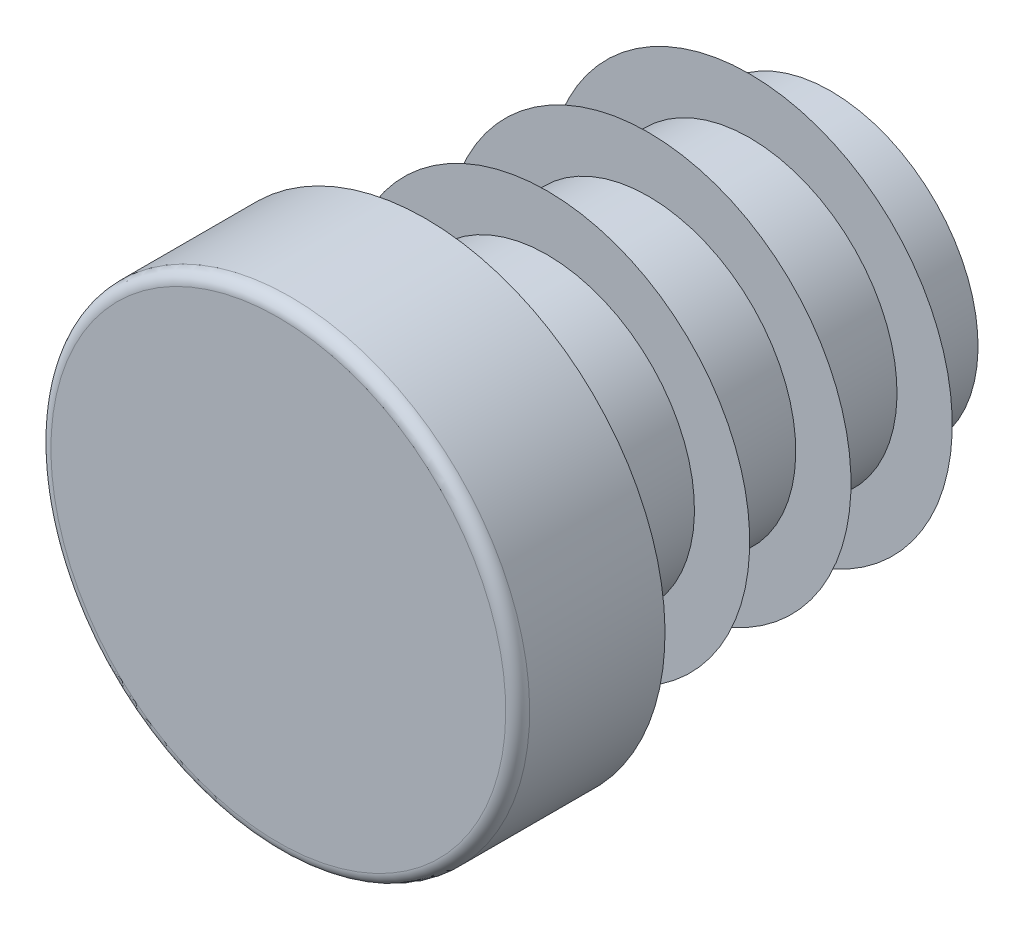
ISO-10303-21;
HEADER;
FILE_DESCRIPTION(('STEP AP214'),'2;1');
FILE_NAME('part.step','',(''),(''),'','','');
FILE_SCHEMA(('AUTOMOTIVE_DESIGN { 1 0 10303 214 1 1 1 1 }'));
ENDSEC;
DATA;
#1=APPLICATION_CONTEXT('core data for automotive mechanical design processes');
#2=APPLICATION_PROTOCOL_DEFINITION('international standard','automotive_design',2000,#1);
#3=PRODUCT_CONTEXT('',#1,'mechanical');
#4=PRODUCT('Part','Part','',(#3));
#5=PRODUCT_RELATED_PRODUCT_CATEGORY('part','',(#4));
#6=PRODUCT_DEFINITION_FORMATION('','',#4);
#7=PRODUCT_DEFINITION_CONTEXT('part definition',#1,'design');
#8=PRODUCT_DEFINITION('design','',#6,#7);
#9=PRODUCT_DEFINITION_SHAPE('','',#8);
#10=(LENGTH_UNIT() NAMED_UNIT(*) SI_UNIT(.MILLI.,.METRE.));
#11=(NAMED_UNIT(*) PLANE_ANGLE_UNIT() SI_UNIT($,.RADIAN.));
#12=(NAMED_UNIT(*) SI_UNIT($,.STERADIAN.) SOLID_ANGLE_UNIT());
#13=UNCERTAINTY_MEASURE_WITH_UNIT(LENGTH_MEASURE(1.E-05),#10,'distance_accuracy_value','');
#14=(GEOMETRIC_REPRESENTATION_CONTEXT(3) GLOBAL_UNCERTAINTY_ASSIGNED_CONTEXT((#13)) GLOBAL_UNIT_ASSIGNED_CONTEXT((#10,
#11,#12)) REPRESENTATION_CONTEXT('',''));
#15=CARTESIAN_POINT('',(0.,0.,0.));
#16=DIRECTION('',(0.,0.,1.));
#17=DIRECTION('',(1.,0.,0.));
#18=AXIS2_PLACEMENT_3D('',#15,#16,#17);
#19=CARTESIAN_POINT('',(0.,0.,4.));
#20=DIRECTION('',(0.,0.,-1.));
#21=DIRECTION('',(0.,1.,0.));
#22=AXIS2_PLACEMENT_3D('',#19,#20,#21);
#23=PLANE('',#22);
#24=CARTESIAN_POINT('',(0.,0.,4.));
#25=DIRECTION('',(0.,0.,-1.));
#26=DIRECTION('',(0.,1.,0.));
#27=AXIS2_PLACEMENT_3D('',#24,#25,#26);
#28=CIRCLE('',#27,6.175);
#29=CARTESIAN_POINT('',(0.,6.175,4.));
#30=VERTEX_POINT('',#29);
#31=EDGE_CURVE('E8',#30,#30,#28,.T.);
#32=ORIENTED_EDGE('',*,*,#31,.F.);
#33=EDGE_LOOP('',(#32));
#34=FACE_BOUND('',#33,.T.);
#35=ADVANCED_FACE('F12',(#34),#23,.F.);
#36=CARTESIAN_POINT('',(0.,0.,3.675));
#37=DIRECTION('',(0.,0.,-1.));
#38=DIRECTION('',(0.,1.,0.));
#39=AXIS2_PLACEMENT_3D('',#36,#37,#38);
#40=TOROIDAL_SURFACE('',#39,6.175,0.325);
#41=ORIENTED_EDGE('',*,*,#31,.T.);
#42=EDGE_LOOP('',(#41));
#43=FACE_BOUND('',#42,.T.);
#44=CARTESIAN_POINT('',(0.,0.,3.675));
#45=DIRECTION('',(0.,0.,-1.));
#46=DIRECTION('',(0.,1.,0.));
#47=AXIS2_PLACEMENT_3D('',#44,#45,#46);
#48=CIRCLE('',#47,6.5);
#49=CARTESIAN_POINT('',(0.,6.5,3.675));
#50=VERTEX_POINT('',#49);
#51=EDGE_CURVE('E18',#50,#50,#48,.T.);
#52=ORIENTED_EDGE('',*,*,#51,.F.);
#53=EDGE_LOOP('',(#52));
#54=FACE_BOUND('',#53,.T.);
#55=ADVANCED_FACE('F159',(#43,#54),#40,.T.);
#56=CARTESIAN_POINT('',(0.,0.,-11.));
#57=DIRECTION('',(0.,0.,-1.));
#58=DIRECTION('',(0.,1.,0.));
#59=AXIS2_PLACEMENT_3D('',#56,#57,#58);
#60=CYLINDRICAL_SURFACE('',#59,6.5);
#61=CARTESIAN_POINT('',(0.,0.,0.));
#62=DIRECTION('',(0.,0.,-1.));
#63=DIRECTION('',(0.,1.,0.));
#64=AXIS2_PLACEMENT_3D('',#61,#62,#63);
#65=CIRCLE('',#64,6.5);
#66=CARTESIAN_POINT('',(0.,6.5,0.));
#67=VERTEX_POINT('',#66);
#68=EDGE_CURVE('E22',#67,#67,#65,.T.);
#69=ORIENTED_EDGE('',*,*,#68,.F.);
#70=EDGE_LOOP('',(#69));
#71=FACE_BOUND('',#70,.T.);
#72=ORIENTED_EDGE('',*,*,#51,.T.);
#73=EDGE_LOOP('',(#72));
#74=FACE_BOUND('',#73,.T.);
#75=ADVANCED_FACE('F154',(#71,#74),#60,.T.);
#76=CARTESIAN_POINT('',(6.5,0.,0.));
#77=DIRECTION('',(0.,0.,1.));
#78=DIRECTION('',(0.,-1.,0.));
#79=AXIS2_PLACEMENT_3D('',#76,#77,#78);
#80=PLANE('',#79);
#81=CARTESIAN_POINT('',(0.,0.,0.));
#82=DIRECTION('',(0.,0.,-1.));
#83=DIRECTION('',(0.,1.,0.));
#84=AXIS2_PLACEMENT_3D('',#81,#82,#83);
#85=CIRCLE('',#84,4.);
#86=CARTESIAN_POINT('',(0.,4.,0.));
#87=VERTEX_POINT('',#86);
#88=EDGE_CURVE('E26',#87,#87,#85,.T.);
#89=ORIENTED_EDGE('',*,*,#88,.F.);
#90=EDGE_LOOP('',(#89));
#91=FACE_BOUND('',#90,.T.);
#92=ORIENTED_EDGE('',*,*,#68,.T.);
#93=EDGE_LOOP('',(#92));
#94=FACE_BOUND('',#93,.T.);
#95=ADVANCED_FACE('F148',(#91,#94),#80,.F.);
#96=CARTESIAN_POINT('',(0.,0.,-11.));
#97=DIRECTION('',(0.,0.,-1.));
#98=DIRECTION('',(0.,1.,0.));
#99=AXIS2_PLACEMENT_3D('',#96,#97,#98);
#100=CYLINDRICAL_SURFACE('',#99,4.);
#101=CARTESIAN_POINT('',(0.,0.,-0.55));
#102=DIRECTION('',(0.,0.,-1.));
#103=DIRECTION('',(0.,1.,0.));
#104=AXIS2_PLACEMENT_3D('',#101,#102,#103);
#105=CIRCLE('',#104,4.);
#106=CARTESIAN_POINT('',(0.,4.,-0.55));
#107=VERTEX_POINT('',#106);
#108=EDGE_CURVE('E31',#107,#107,#105,.T.);
#109=ORIENTED_EDGE('',*,*,#108,.F.);
#110=EDGE_LOOP('',(#109));
#111=FACE_BOUND('',#110,.T.);
#112=ORIENTED_EDGE('',*,*,#88,.T.);
#113=EDGE_LOOP('',(#112));
#114=FACE_BOUND('',#113,.T.);
#115=ADVANCED_FACE('F142',(#111,#114),#100,.T.);
#116=CARTESIAN_POINT('',(4.,0.,-0.55));
#117=DIRECTION('',(0.,0.,-1.));
#118=DIRECTION('',(0.,1.,0.));
#119=AXIS2_PLACEMENT_3D('',#116,#117,#118);
#120=PLANE('',#119);
#121=CARTESIAN_POINT('',(0.,0.,-0.55));
#122=DIRECTION('',(0.,0.,-1.));
#123=DIRECTION('',(0.,1.,0.));
#124=AXIS2_PLACEMENT_3D('',#121,#122,#123);
#125=CIRCLE('',#124,5.5);
#126=CARTESIAN_POINT('',(0.,5.5,-0.55));
#127=VERTEX_POINT('',#126);
#128=EDGE_CURVE('E34',#127,#127,#125,.T.);
#129=ORIENTED_EDGE('',*,*,#128,.F.);
#130=EDGE_LOOP('',(#129));
#131=FACE_BOUND('',#130,.T.);
#132=ORIENTED_EDGE('',*,*,#108,.T.);
#133=EDGE_LOOP('',(#132));
#134=FACE_BOUND('',#133,.T.);
#135=ADVANCED_FACE('F136',(#131,#134),#120,.F.);
#136=CARTESIAN_POINT('',(0.,0.,-0.55));
#137=DIRECTION('',(0.,0.,1.));
#138=DIRECTION('',(0.,-1.,0.));
#139=AXIS2_PLACEMENT_3D('',#136,#137,#138);
#140=CONICAL_SURFACE('',#139,5.5,0.959931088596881);
#141=CARTESIAN_POINT('',(0.,0.,-1.60031130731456));
#142=DIRECTION('',(0.,0.,-1.));
#143=DIRECTION('',(0.,1.,0.));
#144=AXIS2_PLACEMENT_3D('',#141,#142,#143);
#145=CIRCLE('',#144,4.);
#146=CARTESIAN_POINT('',(0.,4.,-1.60031130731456));
#147=VERTEX_POINT('',#146);
#148=EDGE_CURVE('E37',#147,#147,#145,.T.);
#149=ORIENTED_EDGE('',*,*,#148,.F.);
#150=EDGE_LOOP('',(#149));
#151=FACE_BOUND('',#150,.T.);
#152=ORIENTED_EDGE('',*,*,#128,.T.);
#153=EDGE_LOOP('',(#152));
#154=FACE_BOUND('',#153,.T.);
#155=ADVANCED_FACE('F130',(#151,#154),#140,.T.);
#156=CARTESIAN_POINT('',(0.,0.,-11.));
#157=DIRECTION('',(0.,0.,-1.));
#158=DIRECTION('',(0.,1.,0.));
#159=AXIS2_PLACEMENT_3D('',#156,#157,#158);
#160=CYLINDRICAL_SURFACE('',#159,4.);
#161=CARTESIAN_POINT('',(0.,0.,-3.3));
#162=DIRECTION('',(0.,0.,-1.));
#163=DIRECTION('',(0.,1.,0.));
#164=AXIS2_PLACEMENT_3D('',#161,#162,#163);
#165=CIRCLE('',#164,4.);
#166=CARTESIAN_POINT('',(0.,4.,-3.3));
#167=VERTEX_POINT('',#166);
#168=EDGE_CURVE('E40',#167,#167,#165,.T.);
#169=ORIENTED_EDGE('',*,*,#168,.F.);
#170=EDGE_LOOP('',(#169));
#171=FACE_BOUND('',#170,.T.);
#172=ORIENTED_EDGE('',*,*,#148,.T.);
#173=EDGE_LOOP('',(#172));
#174=FACE_BOUND('',#173,.T.);
#175=ADVANCED_FACE('F124',(#171,#174),#160,.T.);
#176=CARTESIAN_POINT('',(4.,0.,-3.3));
#177=DIRECTION('',(0.,0.,-1.));
#178=DIRECTION('',(0.,1.,0.));
#179=AXIS2_PLACEMENT_3D('',#176,#177,#178);
#180=PLANE('',#179);
#181=CARTESIAN_POINT('',(0.,0.,-3.3));
#182=DIRECTION('',(0.,0.,-1.));
#183=DIRECTION('',(0.,1.,0.));
#184=AXIS2_PLACEMENT_3D('',#181,#182,#183);
#185=CIRCLE('',#184,5.5);
#186=CARTESIAN_POINT('',(0.,5.5,-3.3));
#187=VERTEX_POINT('',#186);
#188=EDGE_CURVE('E43',#187,#187,#185,.T.);
#189=ORIENTED_EDGE('',*,*,#188,.F.);
#190=EDGE_LOOP('',(#189));
#191=FACE_BOUND('',#190,.T.);
#192=ORIENTED_EDGE('',*,*,#168,.T.);
#193=EDGE_LOOP('',(#192));
#194=FACE_BOUND('',#193,.T.);
#195=ADVANCED_FACE('F118',(#191,#194),#180,.F.);
#196=CARTESIAN_POINT('',(0.,0.,-3.3));
#197=DIRECTION('',(0.,0.,1.));
#198=DIRECTION('',(0.,-1.,0.));
#199=AXIS2_PLACEMENT_3D('',#196,#197,#198);
#200=CONICAL_SURFACE('',#199,5.5,0.959931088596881);
#201=CARTESIAN_POINT('',(0.,0.,-4.35031130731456));
#202=DIRECTION('',(0.,0.,-1.));
#203=DIRECTION('',(0.,1.,0.));
#204=AXIS2_PLACEMENT_3D('',#201,#202,#203);
#205=CIRCLE('',#204,4.);
#206=CARTESIAN_POINT('',(0.,4.,-4.35031130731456));
#207=VERTEX_POINT('',#206);
#208=EDGE_CURVE('E46',#207,#207,#205,.T.);
#209=ORIENTED_EDGE('',*,*,#208,.F.);
#210=EDGE_LOOP('',(#209));
#211=FACE_BOUND('',#210,.T.);
#212=ORIENTED_EDGE('',*,*,#188,.T.);
#213=EDGE_LOOP('',(#212));
#214=FACE_BOUND('',#213,.T.);
#215=ADVANCED_FACE('F112',(#211,#214),#200,.T.);
#216=CARTESIAN_POINT('',(0.,0.,-11.));
#217=DIRECTION('',(0.,0.,-1.));
#218=DIRECTION('',(0.,1.,0.));
#219=AXIS2_PLACEMENT_3D('',#216,#217,#218);
#220=CYLINDRICAL_SURFACE('',#219,4.);
#221=CARTESIAN_POINT('',(0.,0.,-6.05));
#222=DIRECTION('',(0.,0.,-1.));
#223=DIRECTION('',(0.,1.,0.));
#224=AXIS2_PLACEMENT_3D('',#221,#222,#223);
#225=CIRCLE('',#224,4.);
#226=CARTESIAN_POINT('',(0.,4.,-6.05));
#227=VERTEX_POINT('',#226);
#228=EDGE_CURVE('E49',#227,#227,#225,.T.);
#229=ORIENTED_EDGE('',*,*,#228,.F.);
#230=EDGE_LOOP('',(#229));
#231=FACE_BOUND('',#230,.T.);
#232=ORIENTED_EDGE('',*,*,#208,.T.);
#233=EDGE_LOOP('',(#232));
#234=FACE_BOUND('',#233,.T.);
#235=ADVANCED_FACE('F106',(#231,#234),#220,.T.);
#236=CARTESIAN_POINT('',(4.,0.,-6.05));
#237=DIRECTION('',(0.,0.,-1.));
#238=DIRECTION('',(0.,1.,0.));
#239=AXIS2_PLACEMENT_3D('',#236,#237,#238);
#240=PLANE('',#239);
#241=CARTESIAN_POINT('',(0.,0.,-6.05));
#242=DIRECTION('',(0.,0.,-1.));
#243=DIRECTION('',(0.,1.,0.));
#244=AXIS2_PLACEMENT_3D('',#241,#242,#243);
#245=CIRCLE('',#244,5.5);
#246=CARTESIAN_POINT('',(0.,5.5,-6.05));
#247=VERTEX_POINT('',#246);
#248=EDGE_CURVE('E52',#247,#247,#245,.T.);
#249=ORIENTED_EDGE('',*,*,#248,.F.);
#250=EDGE_LOOP('',(#249));
#251=FACE_BOUND('',#250,.T.);
#252=ORIENTED_EDGE('',*,*,#228,.T.);
#253=EDGE_LOOP('',(#252));
#254=FACE_BOUND('',#253,.T.);
#255=ADVANCED_FACE('F100',(#251,#254),#240,.F.);
#256=CARTESIAN_POINT('',(0.,0.,-6.05));
#257=DIRECTION('',(0.,0.,1.));
#258=DIRECTION('',(0.,-1.,0.));
#259=AXIS2_PLACEMENT_3D('',#256,#257,#258);
#260=CONICAL_SURFACE('',#259,5.5,0.959931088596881);
#261=CARTESIAN_POINT('',(0.,0.,-7.10031130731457));
#262=DIRECTION('',(0.,0.,-1.));
#263=DIRECTION('',(0.,1.,0.));
#264=AXIS2_PLACEMENT_3D('',#261,#262,#263);
#265=CIRCLE('',#264,4.);
#266=CARTESIAN_POINT('',(0.,4.,-7.10031130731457));
#267=VERTEX_POINT('',#266);
#268=EDGE_CURVE('E55',#267,#267,#265,.T.);
#269=ORIENTED_EDGE('',*,*,#268,.F.);
#270=EDGE_LOOP('',(#269));
#271=FACE_BOUND('',#270,.T.);
#272=ORIENTED_EDGE('',*,*,#248,.T.);
#273=EDGE_LOOP('',(#272));
#274=FACE_BOUND('',#273,.T.);
#275=ADVANCED_FACE('F94',(#271,#274),#260,.T.);
#276=CARTESIAN_POINT('',(0.,0.,-11.));
#277=DIRECTION('',(0.,0.,-1.));
#278=DIRECTION('',(0.,1.,0.));
#279=AXIS2_PLACEMENT_3D('',#276,#277,#278);
#280=CYLINDRICAL_SURFACE('',#279,4.);
#281=CARTESIAN_POINT('',(0.,0.,-8.8));
#282=DIRECTION('',(0.,0.,-1.));
#283=DIRECTION('',(0.,1.,0.));
#284=AXIS2_PLACEMENT_3D('',#281,#282,#283);
#285=CIRCLE('',#284,4.);
#286=CARTESIAN_POINT('',(0.,4.,-8.8));
#287=VERTEX_POINT('',#286);
#288=EDGE_CURVE('E58',#287,#287,#285,.T.);
#289=ORIENTED_EDGE('',*,*,#288,.F.);
#290=EDGE_LOOP('',(#289));
#291=FACE_BOUND('',#290,.T.);
#292=ORIENTED_EDGE('',*,*,#268,.T.);
#293=EDGE_LOOP('',(#292));
#294=FACE_BOUND('',#293,.T.);
#295=ADVANCED_FACE('F88',(#291,#294),#280,.T.);
#296=CARTESIAN_POINT('',(4.,0.,-8.8));
#297=DIRECTION('',(0.,0.,-1.));
#298=DIRECTION('',(0.,1.,0.));
#299=AXIS2_PLACEMENT_3D('',#296,#297,#298);
#300=PLANE('',#299);
#301=CARTESIAN_POINT('',(0.,0.,-8.8));
#302=DIRECTION('',(0.,0.,-1.));
#303=DIRECTION('',(0.,1.,0.));
#304=AXIS2_PLACEMENT_3D('',#301,#302,#303);
#305=CIRCLE('',#304,5.5);
#306=CARTESIAN_POINT('',(0.,5.5,-8.8));
#307=VERTEX_POINT('',#306);
#308=EDGE_CURVE('E61',#307,#307,#305,.T.);
#309=ORIENTED_EDGE('',*,*,#308,.F.);
#310=EDGE_LOOP('',(#309));
#311=FACE_BOUND('',#310,.T.);
#312=ORIENTED_EDGE('',*,*,#288,.T.);
#313=EDGE_LOOP('',(#312));
#314=FACE_BOUND('',#313,.T.);
#315=ADVANCED_FACE('F82',(#311,#314),#300,.F.);
#316=CARTESIAN_POINT('',(0.,0.,-8.8));
#317=DIRECTION('',(0.,0.,1.));
#318=DIRECTION('',(0.,-1.,0.));
#319=AXIS2_PLACEMENT_3D('',#316,#317,#318);
#320=CONICAL_SURFACE('',#319,5.5,0.959931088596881);
#321=CARTESIAN_POINT('',(0.,0.,-9.85031130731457));
#322=DIRECTION('',(0.,0.,-1.));
#323=DIRECTION('',(0.,1.,0.));
#324=AXIS2_PLACEMENT_3D('',#321,#322,#323);
#325=CIRCLE('',#324,4.);
#326=CARTESIAN_POINT('',(0.,4.,-9.85031130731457));
#327=VERTEX_POINT('',#326);
#328=EDGE_CURVE('E64',#327,#327,#325,.T.);
#329=ORIENTED_EDGE('',*,*,#328,.F.);
#330=EDGE_LOOP('',(#329));
#331=FACE_BOUND('',#330,.T.);
#332=ORIENTED_EDGE('',*,*,#308,.T.);
#333=EDGE_LOOP('',(#332));
#334=FACE_BOUND('',#333,.T.);
#335=ADVANCED_FACE('F76',(#331,#334),#320,.T.);
#336=CARTESIAN_POINT('',(0.,0.,-11.));
#337=DIRECTION('',(0.,0.,-1.));
#338=DIRECTION('',(0.,1.,0.));
#339=AXIS2_PLACEMENT_3D('',#336,#337,#338);
#340=CYLINDRICAL_SURFACE('',#339,4.);
#341=CARTESIAN_POINT('',(0.,0.,-11.));
#342=DIRECTION('',(0.,0.,-1.));
#343=DIRECTION('',(0.,1.,0.));
#344=AXIS2_PLACEMENT_3D('',#341,#342,#343);
#345=CIRCLE('',#344,4.);
#346=CARTESIAN_POINT('',(0.,4.,-11.));
#347=VERTEX_POINT('',#346);
#348=EDGE_CURVE('E67',#347,#347,#345,.T.);
#349=ORIENTED_EDGE('',*,*,#348,.F.);
#350=EDGE_LOOP('',(#349));
#351=FACE_BOUND('',#350,.T.);
#352=ORIENTED_EDGE('',*,*,#328,.T.);
#353=EDGE_LOOP('',(#352));
#354=FACE_BOUND('',#353,.T.);
#355=ADVANCED_FACE('F73',(#351,#354),#340,.T.);
#356=CARTESIAN_POINT('',(4.,0.,-11.));
#357=DIRECTION('',(0.,0.,1.));
#358=DIRECTION('',(0.,-1.,0.));
#359=AXIS2_PLACEMENT_3D('',#356,#357,#358);
#360=PLANE('',#359);
#361=ORIENTED_EDGE('',*,*,#348,.T.);
#362=EDGE_LOOP('',(#361));
#363=FACE_BOUND('',#362,.T.);
#364=ADVANCED_FACE('F71',(#363),#360,.F.);
#365=CLOSED_SHELL('',(#35,#55,#75,#95,#115,#135,#155,#175,#195,#215,#235,#255,#275,#295,#315,
#335,#355,#364));
#366=MANIFOLD_SOLID_BREP('B1',#365);
#367=ADVANCED_BREP_SHAPE_REPRESENTATION('',(#18,#366),#14);
#368=SHAPE_DEFINITION_REPRESENTATION(#9,#367);
ENDSEC;
END-ISO-10303-21;
